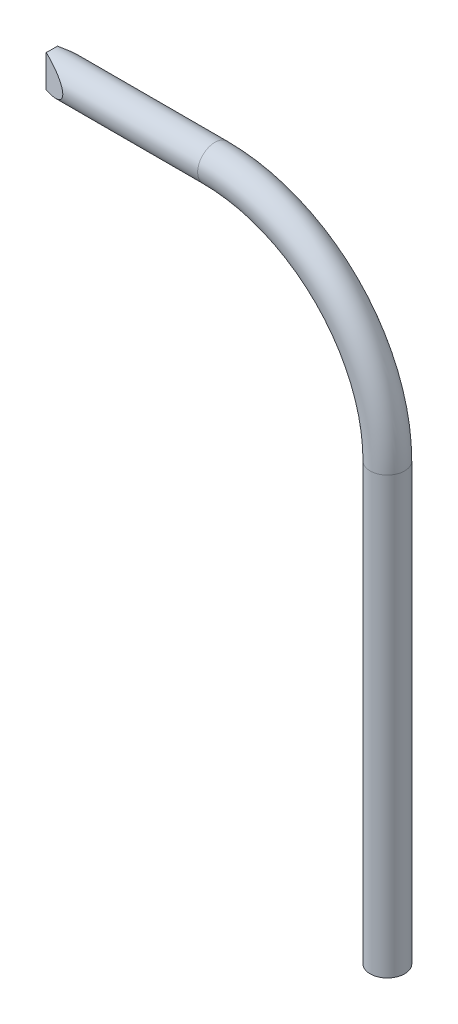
ISO-10303-21;
HEADER;
FILE_DESCRIPTION(('STEP AP214'),'2;1');
FILE_NAME('part.step','',(''),(''),'','','');
FILE_SCHEMA(('AUTOMOTIVE_DESIGN { 1 0 10303 214 1 1 1 1 }'));
ENDSEC;
DATA;
#1=APPLICATION_CONTEXT('core data for automotive mechanical design processes');
#2=APPLICATION_PROTOCOL_DEFINITION('international standard','automotive_design',2000,#1);
#3=PRODUCT_CONTEXT('',#1,'mechanical');
#4=PRODUCT('Part','Part','',(#3));
#5=PRODUCT_RELATED_PRODUCT_CATEGORY('part','',(#4));
#6=PRODUCT_DEFINITION_FORMATION('','',#4);
#7=PRODUCT_DEFINITION_CONTEXT('part definition',#1,'design');
#8=PRODUCT_DEFINITION('design','',#6,#7);
#9=PRODUCT_DEFINITION_SHAPE('','',#8);
#10=(LENGTH_UNIT() NAMED_UNIT(*) SI_UNIT(.MILLI.,.METRE.));
#11=(NAMED_UNIT(*) PLANE_ANGLE_UNIT() SI_UNIT($,.RADIAN.));
#12=(NAMED_UNIT(*) SI_UNIT($,.STERADIAN.) SOLID_ANGLE_UNIT());
#13=UNCERTAINTY_MEASURE_WITH_UNIT(LENGTH_MEASURE(1.E-05),#10,'distance_accuracy_value','');
#14=(GEOMETRIC_REPRESENTATION_CONTEXT(3) GLOBAL_UNCERTAINTY_ASSIGNED_CONTEXT((#13)) GLOBAL_UNIT_ASSIGNED_CONTEXT((#10,
#11,#12)) REPRESENTATION_CONTEXT('',''));
#15=CARTESIAN_POINT('',(0.,0.,0.));
#16=DIRECTION('',(0.,0.,1.));
#17=DIRECTION('',(1.,0.,0.));
#18=AXIS2_PLACEMENT_3D('',#15,#16,#17);
#19=CARTESIAN_POINT('',(-517.3378077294,1340.,0.));
#20=DIRECTION('',(-1.,0.,0.));
#21=DIRECTION('',(0.,0.,1.));
#22=AXIS2_PLACEMENT_3D('',#19,#20,#21);
#23=CYLINDRICAL_SURFACE('',#22,20.);
#24=CARTESIAN_POINT('',(-517.3378077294,1340.,0.));
#25=DIRECTION('',(1.,0.,0.));
#26=DIRECTION('',(0.,1.,0.));
#27=AXIS2_PLACEMENT_3D('',#24,#25,#26);
#28=CIRCLE('',#27,20.);
#29=CARTESIAN_POINT('',(-517.3378077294,1360.,0.));
#30=VERTEX_POINT('',#29);
#31=EDGE_CURVE('E52',#30,#30,#28,.T.);
#32=ORIENTED_EDGE('',*,*,#31,.F.);
#33=EDGE_LOOP('',(#32));
#34=FACE_BOUND('',#33,.T.);
#35=CARTESIAN_POINT('',(-721.11640747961,1329.18883658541,-16.8261328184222));
#36=CARTESIAN_POINT('',(-720.952862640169,1329.17528750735,-16.8174223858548));
#37=CARTESIAN_POINT('',(-720.789787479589,1329.15806444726,-16.8063382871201));
#38=CARTESIAN_POINT('',(-720.464960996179,1329.11662612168,-16.7795356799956));
#39=CARTESIAN_POINT('',(-720.303209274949,1329.09241304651,-16.7638186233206));
#40=CARTESIAN_POINT('',(-719.821301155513,1329.00996637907,-16.709981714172));
#41=CARTESIAN_POINT('',(-719.503534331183,1328.94184214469,-16.665123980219));
#42=CARTESIAN_POINT('',(-718.880745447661,1328.78401501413,-16.5593032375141));
#43=CARTESIAN_POINT('',(-718.575612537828,1328.69459837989,-16.49855290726));
#44=CARTESIAN_POINT('',(-717.974566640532,1328.4975996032,-16.361820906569));
#45=CARTESIAN_POINT('',(-717.678661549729,1328.39000238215,-16.2858265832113));
#46=CARTESIAN_POINT('',(-716.953840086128,1328.10408688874,-16.0789209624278));
#47=CARTESIAN_POINT('',(-716.530866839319,1327.91696529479,-15.9393555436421));
#48=CARTESIAN_POINT('',(-715.7061474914,1327.52113477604,-15.6314073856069));
#49=CARTESIAN_POINT('',(-715.30440969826,1327.3124174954,-15.4630134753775));
#50=CARTESIAN_POINT('',(-714.518277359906,1326.87982839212,-15.0977429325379));
#51=CARTESIAN_POINT('',(-714.134030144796,1326.65585742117,-14.9006681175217));
#52=CARTESIAN_POINT('',(-713.385174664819,1326.2004558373,-14.479942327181));
#53=CARTESIAN_POINT('',(-713.020563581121,1325.96902630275,-14.2562951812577));
#54=CARTESIAN_POINT('',(-712.287398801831,1325.48855852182,-13.7674626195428));
#55=CARTESIAN_POINT('',(-711.920123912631,1325.23935194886,-13.5005236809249));
#56=CARTESIAN_POINT('',(-711.207348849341,1324.7431086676,-12.9370883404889));
#57=CARTESIAN_POINT('',(-710.861850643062,1324.49607215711,-12.6405892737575));
#58=CARTESIAN_POINT('',(-710.194401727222,1324.00927808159,-12.018831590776));
#59=CARTESIAN_POINT('',(-709.872391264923,1323.76950302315,-11.6936509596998));
#60=CARTESIAN_POINT('',(-709.252487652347,1323.30073906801,-11.0138597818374));
#61=CARTESIAN_POINT('',(-708.954590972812,1323.07174859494,-10.6592535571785));
#62=CARTESIAN_POINT('',(-708.419760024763,1322.65563040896,-9.96573589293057));
#63=CARTESIAN_POINT('',(-708.179818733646,1322.46679953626,-9.63016635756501));
#64=CARTESIAN_POINT('',(-707.722086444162,1322.10345385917,-8.93682196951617));
#65=CARTESIAN_POINT('',(-707.504295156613,1321.92893886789,-8.57904740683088));
#66=CARTESIAN_POINT('',(-707.09315418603,1321.59721476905,-7.84223547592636));
#67=CARTESIAN_POINT('',(-706.899794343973,1321.43999847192,-7.46320704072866));
#68=CARTESIAN_POINT('',(-706.539869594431,1321.14575947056,-6.68509643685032));
#69=CARTESIAN_POINT('',(-706.373300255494,1321.00873342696,-6.28601759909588));
#70=CARTESIAN_POINT('',(-706.093097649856,1320.77726927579,-5.53323752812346));
#71=CARTESIAN_POINT('',(-705.975260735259,1320.67952206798,-5.18211484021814));
#72=CARTESIAN_POINT('',(-705.762015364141,1320.5021475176,-4.46864802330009));
#73=CARTESIAN_POINT('',(-705.666604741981,1320.42251842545,-4.10630498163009));
#74=CARTESIAN_POINT('',(-705.499625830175,1320.28288430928,-3.3726405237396));
#75=CARTESIAN_POINT('',(-705.42804492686,1320.22286890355,-3.00132396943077));
#76=CARTESIAN_POINT('',(-705.309789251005,1320.12359666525,-2.25198043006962));
#77=CARTESIAN_POINT('',(-705.263114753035,1320.08434006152,-1.87395337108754));
#78=CARTESIAN_POINT('',(-705.195355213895,1320.02731822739,-1.11271652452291));
#79=CARTESIAN_POINT('',(-705.174355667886,1320.00962480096,-0.729493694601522));
#80=CARTESIAN_POINT('',(-705.158603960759,1319.99635481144,0.0378773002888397));
#81=CARTESIAN_POINT('',(-705.163851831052,1320.00077827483,0.422025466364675));
#82=CARTESIAN_POINT('',(-705.200500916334,1320.03164484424,1.18819138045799));
#83=CARTESIAN_POINT('',(-705.231903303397,1320.05808893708,1.57020903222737));
#84=CARTESIAN_POINT('',(-705.320311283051,1320.13242641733,2.32914120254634));
#85=CARTESIAN_POINT('',(-705.377316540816,1320.18031952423,2.70605578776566));
#86=CARTESIAN_POINT('',(-705.512540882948,1320.2936790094,3.43361464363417));
#87=CARTESIAN_POINT('',(-705.589570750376,1320.35815861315,3.78463598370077));
#88=CARTESIAN_POINT('',(-705.764816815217,1320.50445212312,4.47761320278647));
#89=CARTESIAN_POINT('',(-705.863031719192,1320.58626497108,4.81956963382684));
#90=CARTESIAN_POINT('',(-706.079448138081,1320.76592258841,5.4928788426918));
#91=CARTESIAN_POINT('',(-706.197656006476,1320.86377245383,5.82422820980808));
#92=CARTESIAN_POINT('',(-706.452727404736,1321.0740330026,6.4749321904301));
#93=CARTESIAN_POINT('',(-706.589594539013,1321.186446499,6.79428447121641));
#94=CARTESIAN_POINT('',(-706.932539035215,1321.46671247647,7.53148394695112));
#95=CARTESIAN_POINT('',(-707.145900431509,1321.64004672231,7.94388170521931));
#96=CARTESIAN_POINT('',(-707.601368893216,1322.0068793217,8.74305971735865));
#97=CARTESIAN_POINT('',(-707.843484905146,1322.20038394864,9.12983193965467));
#98=CARTESIAN_POINT('',(-708.353914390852,1322.60397237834,9.87718430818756));
#99=CARTESIAN_POINT('',(-708.622256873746,1322.81407448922,10.2377346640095));
#100=CARTESIAN_POINT('',(-709.182545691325,1323.24695152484,10.9317255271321));
#101=CARTESIAN_POINT('',(-709.474490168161,1323.4697254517,11.2651681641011));
#102=CARTESIAN_POINT('',(-710.084904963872,1323.92785151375,11.9098625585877));
#103=CARTESIAN_POINT('',(-710.403716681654,1324.16334521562,12.2206895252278));
#104=CARTESIAN_POINT('',(-711.062584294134,1324.6397993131,12.8144100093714));
#105=CARTESIAN_POINT('',(-711.402642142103,1324.88076021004,13.097300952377));
#106=CARTESIAN_POINT('',(-712.103652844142,1325.36419604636,13.6354013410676));
#107=CARTESIAN_POINT('',(-712.464625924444,1325.60667224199,13.8905832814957));
#108=CARTESIAN_POINT('',(-713.207098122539,1326.08812720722,14.3727431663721));
#109=CARTESIAN_POINT('',(-713.588593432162,1326.32710661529,14.5997263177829));
#110=CARTESIAN_POINT('',(-714.281199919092,1326.74107020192,14.9753022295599));
#111=CARTESIAN_POINT('',(-714.587958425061,1326.91797314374,15.1298267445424));
#112=CARTESIAN_POINT('',(-715.21443015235,1327.26309591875,15.4214875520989));
#113=CARTESIAN_POINT('',(-715.534143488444,1327.43131567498,15.5586236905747));
#114=CARTESIAN_POINT('',(-716.185311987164,1327.75422003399,15.8140134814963));
#115=CARTESIAN_POINT('',(-716.516695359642,1327.9089720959,15.9323640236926));
#116=CARTESIAN_POINT('',(-717.193206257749,1328.20109199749,16.1498890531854));
#117=CARTESIAN_POINT('',(-717.538330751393,1328.33846364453,16.249067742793));
#118=CARTESIAN_POINT('',(-718.145118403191,1328.55531235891,16.4021830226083));
#119=CARTESIAN_POINT('',(-718.403563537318,1328.64031007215,16.4610546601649));
#120=CARTESIAN_POINT('',(-718.927060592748,1328.79564309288,16.5671725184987));
#121=CARTESIAN_POINT('',(-719.19210885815,1328.86598632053,16.6144250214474));
#122=CARTESIAN_POINT('',(-719.730920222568,1328.9901905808,16.6970009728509));
#123=CARTESIAN_POINT('',(-720.004745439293,1329.04387174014,16.7321946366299));
#124=CARTESIAN_POINT('',(-720.557359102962,1329.13165546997,16.7893266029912));
#125=CARTESIAN_POINT('',(-720.83615552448,1329.16572298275,16.8112411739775));
#126=CARTESIAN_POINT('',(-721.11640747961,1329.18883658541,16.8261328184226));
#127=B_SPLINE_CURVE_WITH_KNOTS('',3,(#35,#36,#37,#38,#39,#40,#41,#42,#43,#44,#45,#46,#47,#48,
#49,#50,#51,#52,#53,#54,#55,#56,#57,#58,#59,#60,#61,#62,#63,#64,#65,#66,#67,#68,#69,#70,#71,#72,
#73,#74,#75,#76,#77,#78,#79,#80,#81,#82,#83,#84,#85,#86,#87,#88,#89,#90,#91,#92,#93,#94,#95,#96,
#97,#98,#99,#100,#101,#102,#103,#104,#105,#106,#107,#108,#109,#110,#111,#112,#113,#114,#115,
#116,#117,#118,#119,#120,#121,#122,#123,#124,#125,#126),.UNSPECIFIED.,.F.,.F.,(4,2,2,2,2,2,2,2,
2,2,2,2,2,2,2,2,2,2,2,2,2,2,2,2,2,2,2,2,2,2,2,2,2,2,2,2,2,2,2,2,2,2,2,2,2,4),(0.,
0.492881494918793,0.985608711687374,1.96818921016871,2.93823929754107,3.909097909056,
5.35612118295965,6.80370644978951,8.26181639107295,9.71971645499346,11.2721984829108,
12.8248205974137,14.3733441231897,15.9216405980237,17.2815110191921,18.6413636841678,
20.0006490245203,21.359709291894,22.5076959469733,23.6555716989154,24.8028388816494,
25.950118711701,27.1012085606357,28.2522997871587,29.403442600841,30.5545703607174,
31.6487406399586,32.7428441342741,33.8372959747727,34.9319595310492,36.4166644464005,
37.9018325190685,39.3886623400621,40.8753752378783,42.385165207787,43.8950941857,
45.4065085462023,46.9176434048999,48.0761052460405,49.2345773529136,50.3868653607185,
51.5389005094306,52.3733709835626,53.2073892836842,54.0501208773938,54.8943541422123),.UNSPECIFIED.);
#128=CARTESIAN_POINT('',(-706.445560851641,1321.06800294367,-6.4482158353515));
#129=VERTEX_POINT('',#128);
#130=CARTESIAN_POINT('',(-706.445560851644,1321.06800294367,6.44821583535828));
#131=VERTEX_POINT('',#130);
#132=EDGE_CURVE('E63',#129,#131,#127,.T.);
#133=ORIENTED_EDGE('',*,*,#132,.F.);
#134=CARTESIAN_POINT('',(-722.012930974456,1340.,0.));
#135=DIRECTION('',(-0.382683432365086,0.,-0.923879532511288));
#136=DIRECTION('',(-0.923879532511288,0.,0.382683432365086));
#137=AXIS2_PLACEMENT_3D('',#134,#135,#136);
#138=ELLIPSE('',#137,52.2625185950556,20.);
#139=CARTESIAN_POINT('',(-706.445560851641,1358.93199705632,-6.4482158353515));
#140=VERTEX_POINT('',#139);
#141=EDGE_CURVE('E74',#140,#129,#138,.T.);
#142=ORIENTED_EDGE('',*,*,#141,.F.);
#143=CARTESIAN_POINT('',(-721.11640747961,1350.81116341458,16.8261328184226));
#144=CARTESIAN_POINT('',(-720.952862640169,1350.82471249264,16.8174223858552));
#145=CARTESIAN_POINT('',(-720.789787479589,1350.84193555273,16.8063382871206));
#146=CARTESIAN_POINT('',(-720.464960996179,1350.88337387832,16.779535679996));
#147=CARTESIAN_POINT('',(-720.303209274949,1350.90758695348,16.7638186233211));
#148=CARTESIAN_POINT('',(-719.821301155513,1350.99003362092,16.7099817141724));
#149=CARTESIAN_POINT('',(-719.503534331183,1351.0581578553,16.6651239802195));
#150=CARTESIAN_POINT('',(-718.880745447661,1351.21598498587,16.5593032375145));
#151=CARTESIAN_POINT('',(-718.575612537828,1351.3054016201,16.4985529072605));
#152=CARTESIAN_POINT('',(-717.974566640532,1351.5024003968,16.3618209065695));
#153=CARTESIAN_POINT('',(-717.67866154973,1351.60999761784,16.2858265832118));
#154=CARTESIAN_POINT('',(-716.953840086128,1351.89591311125,16.0789209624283));
#155=CARTESIAN_POINT('',(-716.530866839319,1352.0830347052,15.9393555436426));
#156=CARTESIAN_POINT('',(-715.7061474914,1352.47886522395,15.6314073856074));
#157=CARTESIAN_POINT('',(-715.30440969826,1352.68758250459,15.463013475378));
#158=CARTESIAN_POINT('',(-714.518277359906,1353.12017160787,15.0977429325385));
#159=CARTESIAN_POINT('',(-714.134030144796,1353.34414257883,14.9006681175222));
#160=CARTESIAN_POINT('',(-713.385174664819,1353.7995441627,14.4799423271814));
#161=CARTESIAN_POINT('',(-713.020563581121,1354.03097369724,14.2562951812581));
#162=CARTESIAN_POINT('',(-712.287398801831,1354.51144147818,13.7674626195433));
#163=CARTESIAN_POINT('',(-711.920123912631,1354.76064805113,13.5005236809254));
#164=CARTESIAN_POINT('',(-711.207348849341,1355.2568913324,12.9370883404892));
#165=CARTESIAN_POINT('',(-710.861850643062,1355.50392784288,12.6405892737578));
#166=CARTESIAN_POINT('',(-710.194401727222,1355.99072191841,12.0188315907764));
#167=CARTESIAN_POINT('',(-709.872391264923,1356.23049697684,11.6936509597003));
#168=CARTESIAN_POINT('',(-709.252487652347,1356.69926093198,11.0138597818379));
#169=CARTESIAN_POINT('',(-708.954590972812,1356.92825140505,10.6592535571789));
#170=CARTESIAN_POINT('',(-708.419760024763,1357.34436959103,9.9657358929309));
#171=CARTESIAN_POINT('',(-708.179818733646,1357.53320046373,9.63016635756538));
#172=CARTESIAN_POINT('',(-707.722086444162,1357.89654614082,8.93682196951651));
#173=CARTESIAN_POINT('',(-707.504295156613,1358.0710611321,8.57904740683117));
#174=CARTESIAN_POINT('',(-707.09315418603,1358.40278523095,7.84223547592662));
#175=CARTESIAN_POINT('',(-706.899794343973,1358.56000152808,7.46320704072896));
#176=CARTESIAN_POINT('',(-706.539869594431,1358.85424052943,6.68509643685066));
#177=CARTESIAN_POINT('',(-706.373300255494,1358.99126657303,6.28601759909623));
#178=CARTESIAN_POINT('',(-706.093097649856,1359.2227307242,5.53323752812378));
#179=CARTESIAN_POINT('',(-705.975260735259,1359.32047793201,5.18211484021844));
#180=CARTESIAN_POINT('',(-705.762015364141,1359.49785248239,4.46864802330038));
#181=CARTESIAN_POINT('',(-705.666604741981,1359.57748157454,4.10630498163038));
#182=CARTESIAN_POINT('',(-705.499625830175,1359.71711569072,3.37264052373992));
#183=CARTESIAN_POINT('',(-705.42804492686,1359.77713109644,3.00132396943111));
#184=CARTESIAN_POINT('',(-705.309789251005,1359.87640333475,2.25198043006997));
#185=CARTESIAN_POINT('',(-705.263114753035,1359.91565993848,1.87395337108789));
#186=CARTESIAN_POINT('',(-705.195355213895,1359.9726817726,1.11271652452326));
#187=CARTESIAN_POINT('',(-705.174355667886,1359.99037519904,0.729493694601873));
#188=CARTESIAN_POINT('',(-705.158603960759,1360.00364518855,-0.0378773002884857));
#189=CARTESIAN_POINT('',(-705.163851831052,1359.99922172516,-0.422025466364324));
#190=CARTESIAN_POINT('',(-705.200500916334,1359.96835515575,-1.18819138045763));
#191=CARTESIAN_POINT('',(-705.231903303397,1359.94191106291,-1.570209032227));
#192=CARTESIAN_POINT('',(-705.320311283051,1359.86757358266,-2.32914120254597));
#193=CARTESIAN_POINT('',(-705.377316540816,1359.81968047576,-2.70605578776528));
#194=CARTESIAN_POINT('',(-705.512540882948,1359.70632099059,-3.43361464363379));
#195=CARTESIAN_POINT('',(-705.589570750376,1359.64184138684,-3.78463598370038));
#196=CARTESIAN_POINT('',(-705.764816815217,1359.49554787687,-4.47761320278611));
#197=CARTESIAN_POINT('',(-705.863031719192,1359.41373502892,-4.81956963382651));
#198=CARTESIAN_POINT('',(-706.079448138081,1359.23407741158,-5.49287884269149));
#199=CARTESIAN_POINT('',(-706.197656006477,1359.13622754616,-5.82422820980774));
#200=CARTESIAN_POINT('',(-706.452727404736,1358.92596699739,-6.47493219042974));
#201=CARTESIAN_POINT('',(-706.589594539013,1358.813553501,-6.79428447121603));
#202=CARTESIAN_POINT('',(-706.932539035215,1358.53328752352,-7.53148394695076));
#203=CARTESIAN_POINT('',(-707.145900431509,1358.35995327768,-7.94388170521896));
#204=CARTESIAN_POINT('',(-707.601368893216,1357.99312067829,-8.74305971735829));
#205=CARTESIAN_POINT('',(-707.843484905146,1357.79961605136,-9.12983193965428));
#206=CARTESIAN_POINT('',(-708.353914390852,1357.39602762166,-9.87718430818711));
#207=CARTESIAN_POINT('',(-708.622256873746,1357.18592551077,-10.237734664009));
#208=CARTESIAN_POINT('',(-709.182545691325,1356.75304847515,-10.9317255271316));
#209=CARTESIAN_POINT('',(-709.474490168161,1356.5302745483,-11.2651681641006));
#210=CARTESIAN_POINT('',(-710.084904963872,1356.07214848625,-11.9098625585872));
#211=CARTESIAN_POINT('',(-710.403716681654,1355.83665478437,-12.2206895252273));
#212=CARTESIAN_POINT('',(-711.062584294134,1355.36020068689,-12.8144100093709));
#213=CARTESIAN_POINT('',(-711.402642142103,1355.11923978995,-13.0973009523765));
#214=CARTESIAN_POINT('',(-712.103652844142,1354.63580395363,-13.6354013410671));
#215=CARTESIAN_POINT('',(-712.464625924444,1354.393327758,-13.8905832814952));
#216=CARTESIAN_POINT('',(-713.207098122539,1353.91187279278,-14.3727431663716));
#217=CARTESIAN_POINT('',(-713.588593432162,1353.6728933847,-14.5997263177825));
#218=CARTESIAN_POINT('',(-714.281199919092,1353.25892979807,-14.9753022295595));
#219=CARTESIAN_POINT('',(-714.587958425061,1353.08202685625,-15.129826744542));
#220=CARTESIAN_POINT('',(-715.21443015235,1352.73690408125,-15.4214875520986));
#221=CARTESIAN_POINT('',(-715.534143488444,1352.56868432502,-15.5586236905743));
#222=CARTESIAN_POINT('',(-716.185311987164,1352.245779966,-15.8140134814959));
#223=CARTESIAN_POINT('',(-716.516695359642,1352.09102790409,-15.9323640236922));
#224=CARTESIAN_POINT('',(-717.193206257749,1351.7989080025,-16.149889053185));
#225=CARTESIAN_POINT('',(-717.538330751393,1351.66153635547,-16.2490677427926));
#226=CARTESIAN_POINT('',(-718.145118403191,1351.44468764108,-16.4021830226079));
#227=CARTESIAN_POINT('',(-718.403563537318,1351.35968992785,-16.4610546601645));
#228=CARTESIAN_POINT('',(-718.927060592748,1351.20435690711,-16.5671725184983));
#229=CARTESIAN_POINT('',(-719.19210885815,1351.13401367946,-16.6144250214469));
#230=CARTESIAN_POINT('',(-719.730920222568,1351.00980941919,-16.6970009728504));
#231=CARTESIAN_POINT('',(-720.004745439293,1350.95612825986,-16.7321946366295));
#232=CARTESIAN_POINT('',(-720.557359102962,1350.86834453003,-16.7893266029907));
#233=CARTESIAN_POINT('',(-720.83615552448,1350.83427701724,-16.8112411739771));
#234=CARTESIAN_POINT('',(-721.11640747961,1350.81116341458,-16.8261328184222));
#235=B_SPLINE_CURVE_WITH_KNOTS('',3,(#143,#144,#145,#146,#147,#148,#149,#150,#151,#152,#153,
#154,#155,#156,#157,#158,#159,#160,#161,#162,#163,#164,#165,#166,#167,#168,#169,#170,#171,#172,
#173,#174,#175,#176,#177,#178,#179,#180,#181,#182,#183,#184,#185,#186,#187,#188,#189,#190,#191,
#192,#193,#194,#195,#196,#197,#198,#199,#200,#201,#202,#203,#204,#205,#206,#207,#208,#209,#210,
#211,#212,#213,#214,#215,#216,#217,#218,#219,#220,#221,#222,#223,#224,#225,#226,#227,#228,#229,
#230,#231,#232,#233,#234),.UNSPECIFIED.,.F.,.F.,(4,2,2,2,2,2,2,2,2,2,2,2,2,2,2,2,2,2,2,2,2,2,2,
2,2,2,2,2,2,2,2,2,2,2,2,2,2,2,2,2,2,2,2,2,2,4),(0.,0.492881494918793,0.985608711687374,
1.96818921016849,2.93823929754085,3.90909790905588,5.35612118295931,6.80370644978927,
8.26181639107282,9.71971645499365,11.2721984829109,12.8248205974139,14.3733441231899,
15.921640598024,17.2815110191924,18.6413636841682,20.0006490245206,21.3597092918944,
22.5076959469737,23.6555716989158,24.8028388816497,25.9501187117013,27.101208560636,
28.252299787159,29.4034426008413,30.5545703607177,31.6487406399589,32.7428441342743,
33.8372959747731,34.9319595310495,36.4166644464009,37.9018325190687,39.3886623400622,
40.8753752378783,42.3851652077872,43.8950941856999,45.4065085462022,46.9176434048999,
48.0761052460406,49.2345773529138,50.3868653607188,51.5389005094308,52.3733709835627,
53.2073892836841,54.0501208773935,54.8943541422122),.UNSPECIFIED.);
#236=CARTESIAN_POINT('',(-706.445560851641,1358.93199705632,6.44821583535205));
#237=VERTEX_POINT('',#236);
#238=EDGE_CURVE('E59',#237,#140,#235,.T.);
#239=ORIENTED_EDGE('',*,*,#238,.F.);
#240=CARTESIAN_POINT('',(-722.012930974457,1340.,0.));
#241=DIRECTION('',(-0.382683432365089,0.,0.923879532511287));
#242=DIRECTION('',(-0.923879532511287,0.,-0.382683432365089));
#243=AXIS2_PLACEMENT_3D('',#240,#241,#242);
#244=ELLIPSE('',#243,52.2625185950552,20.);
#245=EDGE_CURVE('E76',#131,#237,#244,.T.);
#246=ORIENTED_EDGE('',*,*,#245,.F.);
#247=EDGE_LOOP('',(#133,#142,#239,#246));
#248=FACE_BOUND('',#247,.T.);
#249=ADVANCED_FACE('F44',(#34,#248),#23,.T.);
#250=CARTESIAN_POINT('',(-722.012930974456,1773.,2.22044604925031E-13));
#251=DIRECTION('',(-0.382683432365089,0.,0.923879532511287));
#252=DIRECTION('',(0.923879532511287,0.,0.382683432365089));
#253=AXIS2_PLACEMENT_3D('',#250,#251,#252);
#254=PLANE('',#253);
#255=ORIENTED_EDGE('',*,*,#245,.T.);
#256=DIRECTION('',(0.,-1.,0.));
#257=VECTOR('',#256,1.);
#258=CARTESIAN_POINT('',(-706.445560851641,1773.,6.44821583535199));
#259=LINE('',#258,#257);
#260=EDGE_CURVE('E77',#237,#131,#259,.T.);
#261=ORIENTED_EDGE('',*,*,#260,.T.);
#262=EDGE_LOOP('',(#255,#261));
#263=FACE_BOUND('',#262,.T.);
#264=ADVANCED_FACE('F95',(#263),#254,.T.);
#265=CARTESIAN_POINT('',(-597.407906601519,1773.,-51.6130910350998));
#266=DIRECTION('',(-0.382683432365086,0.,-0.923879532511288));
#267=DIRECTION('',(-0.923879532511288,0.,0.382683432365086));
#268=AXIS2_PLACEMENT_3D('',#265,#266,#267);
#269=PLANE('',#268);
#270=ORIENTED_EDGE('',*,*,#141,.T.);
#271=DIRECTION('',(0.,-1.,0.));
#272=VECTOR('',#271,1.);
#273=CARTESIAN_POINT('',(-706.445560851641,1773.,-6.4482158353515));
#274=LINE('',#273,#272);
#275=EDGE_CURVE('E13',#129,#140,#274,.F.);
#276=ORIENTED_EDGE('',*,*,#275,.T.);
#277=EDGE_LOOP('',(#270,#276));
#278=FACE_BOUND('',#277,.T.);
#279=ADVANCED_FACE('F79',(#278),#269,.T.);
#280=CARTESIAN_POINT('',(-517.3378077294,1140.,0.));
#281=DIRECTION('',(0.,0.,1.));
#282=DIRECTION('',(1.,0.,0.));
#283=AXIS2_PLACEMENT_3D('',#280,#281,#282);
#284=TOROIDAL_SURFACE('',#283,200.,20.);
#285=CARTESIAN_POINT('',(-317.3378077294,1140.,0.));
#286=DIRECTION('',(0.,-1.,0.));
#287=DIRECTION('',(1.,0.,0.));
#288=AXIS2_PLACEMENT_3D('',#285,#286,#287);
#289=CIRCLE('',#288,20.);
#290=CARTESIAN_POINT('',(-297.3378077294,1140.,0.));
#291=VERTEX_POINT('',#290);
#292=EDGE_CURVE('E83',#291,#291,#289,.T.);
#293=CARTESIAN_POINT('',(-517.3378077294,1140.,0.));
#294=DIRECTION('',(0.,0.,1.));
#295=DIRECTION('',(1.,0.,0.));
#296=AXIS2_PLACEMENT_3D('',#293,#294,#295);
#297=CIRCLE('',#296,220.);
#298=EDGE_CURVE('',#291,#30,#297,.T.);
#299=ORIENTED_EDGE('',*,*,#292,.F.);
#300=ORIENTED_EDGE('',*,*,#31,.T.);
#301=ORIENTED_EDGE('',*,*,#298,.T.);
#302=ORIENTED_EDGE('',*,*,#298,.F.);
#303=EDGE_LOOP('',(#299,#301,#300,#302));
#304=FACE_BOUND('',#303,.T.);
#305=ADVANCED_FACE('F92',(#304),#284,.T.);
#306=CARTESIAN_POINT('',(-317.3378077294,1140.,0.));
#307=DIRECTION('',(0.,-1.,0.));
#308=DIRECTION('',(1.,0.,0.));
#309=AXIS2_PLACEMENT_3D('',#306,#307,#308);
#310=CYLINDRICAL_SURFACE('',#309,20.);
#311=ORIENTED_EDGE('',*,*,#292,.T.);
#312=EDGE_LOOP('',(#311));
#313=FACE_BOUND('',#312,.T.);
#314=CARTESIAN_POINT('',(-317.3378077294,634.999999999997,0.));
#315=DIRECTION('',(0.,-1.,0.));
#316=DIRECTION('',(1.,0.,0.));
#317=AXIS2_PLACEMENT_3D('',#314,#315,#316);
#318=CIRCLE('',#317,20.);
#319=CARTESIAN_POINT('',(-297.3378077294,634.999999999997,0.));
#320=VERTEX_POINT('',#319);
#321=EDGE_CURVE('E80',#320,#320,#318,.T.);
#322=ORIENTED_EDGE('',*,*,#321,.F.);
#323=EDGE_LOOP('',(#322));
#324=FACE_BOUND('',#323,.T.);
#325=ADVANCED_FACE('F111',(#313,#324),#310,.T.);
#326=CARTESIAN_POINT('',(-317.3378077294,634.999999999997,0.));
#327=DIRECTION('',(0.,-1.,0.));
#328=DIRECTION('',(1.,0.,0.));
#329=AXIS2_PLACEMENT_3D('',#326,#327,#328);
#330=PLANE('',#329);
#331=ORIENTED_EDGE('',*,*,#321,.T.);
#332=EDGE_LOOP('',(#331));
#333=FACE_BOUND('',#332,.T.);
#334=ADVANCED_FACE('F108',(#333),#330,.T.);
#335=CARTESIAN_POINT('',(-722.012930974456,1773.,2.22044604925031E-13));
#336=DIRECTION('',(0.,-1.,0.));
#337=DIRECTION('',(0.,0.,-1.));
#338=AXIS2_PLACEMENT_3D('',#335,#336,#337);
#339=CYLINDRICAL_SURFACE('',#338,16.8500000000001);
#340=ORIENTED_EDGE('',*,*,#238,.T.);
#341=ORIENTED_EDGE('',*,*,#275,.F.);
#342=ORIENTED_EDGE('',*,*,#132,.T.);
#343=ORIENTED_EDGE('',*,*,#260,.F.);
#344=EDGE_LOOP('',(#340,#341,#342,#343));
#345=FACE_BOUND('',#344,.T.);
#346=ADVANCED_FACE('F68',(#345),#339,.F.);
#347=CLOSED_SHELL('',(#249,#264,#279,#305,#325,#334,#346));
#348=MANIFOLD_SOLID_BREP('B2',#347);
#349=ADVANCED_BREP_SHAPE_REPRESENTATION('',(#18,#348),#14);
#350=SHAPE_DEFINITION_REPRESENTATION(#9,#349);
ENDSEC;
END-ISO-10303-21;
